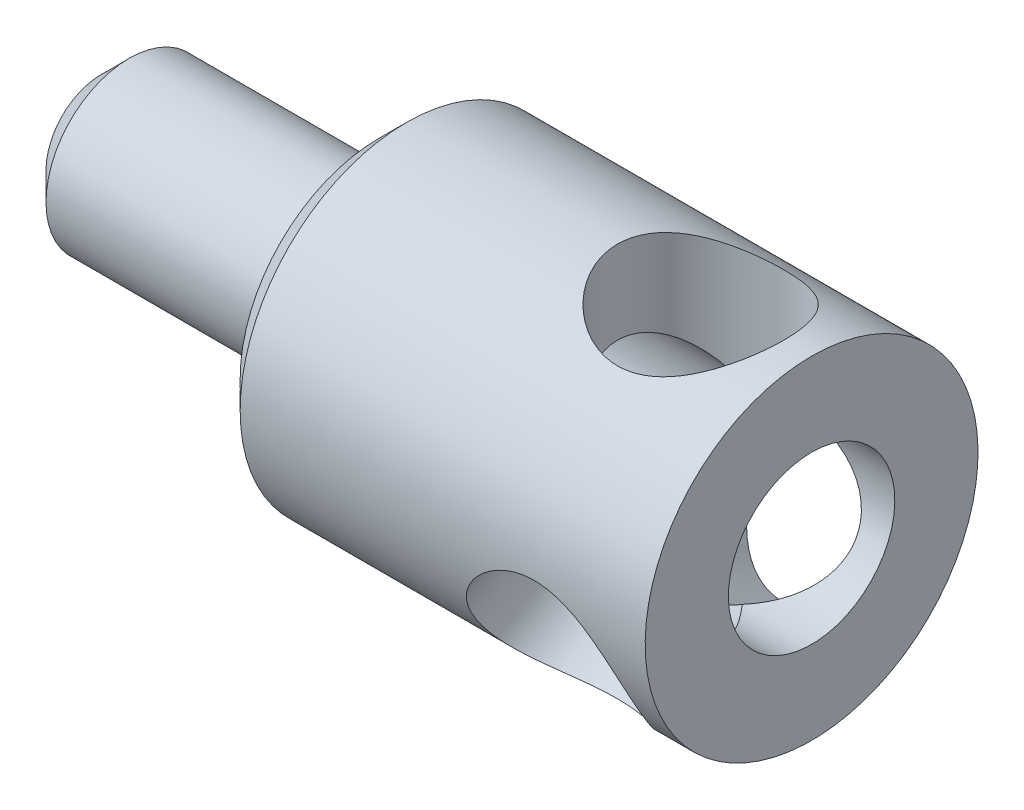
ISO-10303-21;
HEADER;
FILE_DESCRIPTION(('STEP AP214'),'2;1');
FILE_NAME('part.step','',(''),(''),'','','');
FILE_SCHEMA(('AUTOMOTIVE_DESIGN { 1 0 10303 214 1 1 1 1 }'));
ENDSEC;
DATA;
#1=APPLICATION_CONTEXT('core data for automotive mechanical design processes');
#2=APPLICATION_PROTOCOL_DEFINITION('international standard','automotive_design',2000,#1);
#3=PRODUCT_CONTEXT('',#1,'mechanical');
#4=PRODUCT('Part','Part','',(#3));
#5=PRODUCT_RELATED_PRODUCT_CATEGORY('part','',(#4));
#6=PRODUCT_DEFINITION_FORMATION('','',#4);
#7=PRODUCT_DEFINITION_CONTEXT('part definition',#1,'design');
#8=PRODUCT_DEFINITION('design','',#6,#7);
#9=PRODUCT_DEFINITION_SHAPE('','',#8);
#10=(LENGTH_UNIT() NAMED_UNIT(*) SI_UNIT(.MILLI.,.METRE.));
#11=(NAMED_UNIT(*) PLANE_ANGLE_UNIT() SI_UNIT($,.RADIAN.));
#12=(NAMED_UNIT(*) SI_UNIT($,.STERADIAN.) SOLID_ANGLE_UNIT());
#13=UNCERTAINTY_MEASURE_WITH_UNIT(LENGTH_MEASURE(1.E-05),#10,'distance_accuracy_value','');
#14=(GEOMETRIC_REPRESENTATION_CONTEXT(3) GLOBAL_UNCERTAINTY_ASSIGNED_CONTEXT((#13)) GLOBAL_UNIT_ASSIGNED_CONTEXT((#10,
#11,#12)) REPRESENTATION_CONTEXT('',''));
#15=CARTESIAN_POINT('',(0.,0.,0.));
#16=DIRECTION('',(0.,0.,1.));
#17=DIRECTION('',(1.,0.,0.));
#18=AXIS2_PLACEMENT_3D('',#15,#16,#17);
#19=CARTESIAN_POINT('',(4.15747878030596,-2.25,0.));
#20=DIRECTION('',(1.,0.,0.));
#21=DIRECTION('',(0.,1.,0.));
#22=AXIS2_PLACEMENT_3D('',#19,#20,#21);
#23=CYLINDRICAL_SURFACE('',#22,1.5);
#24=CARTESIAN_POINT('',(0.,-2.25,0.));
#25=DIRECTION('',(0.707106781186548,-0.353553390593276,-0.612372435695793));
#26=DIRECTION('',(-0.707106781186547,-0.353553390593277,-0.612372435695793));
#27=AXIS2_PLACEMENT_3D('',#24,#25,#26);
#28=ELLIPSE('',#27,2.12132034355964,1.5);
#29=CARTESIAN_POINT('',(-0.749999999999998,-3.75,0.));
#30=VERTEX_POINT('',#29);
#31=CARTESIAN_POINT('',(-0.749999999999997,-1.5,-1.29903810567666));
#32=VERTEX_POINT('',#31);
#33=EDGE_CURVE('E146',#30,#32,#28,.T.);
#34=ORIENTED_EDGE('',*,*,#33,.T.);
#35=CARTESIAN_POINT('',(0.,-2.25,0.));
#36=DIRECTION('',(0.707106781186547,0.707106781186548,0.));
#37=DIRECTION('',(-0.707106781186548,0.707106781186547,0.));
#38=AXIS2_PLACEMENT_3D('',#35,#36,#37);
#39=ELLIPSE('',#38,2.12132034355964,1.5);
#40=CARTESIAN_POINT('',(-0.750000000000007,-1.49999999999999,1.29903810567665));
#41=VERTEX_POINT('',#40);
#42=EDGE_CURVE('E80',#32,#41,#39,.T.);
#43=ORIENTED_EDGE('',*,*,#42,.T.);
#44=CARTESIAN_POINT('',(0.,-2.25,0.));
#45=DIRECTION('',(0.707106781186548,-0.353553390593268,0.612372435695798));
#46=DIRECTION('',(-0.707106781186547,-0.353553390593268,0.612372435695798));
#47=AXIS2_PLACEMENT_3D('',#44,#45,#46);
#48=ELLIPSE('',#47,2.12132034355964,1.5);
#49=EDGE_CURVE('E42',#41,#30,#48,.T.);
#50=ORIENTED_EDGE('',*,*,#49,.T.);
#51=EDGE_LOOP('',(#34,#43,#50));
#52=FACE_BOUND('',#51,.T.);
#53=CARTESIAN_POINT('',(-4.8,-2.25,0.));
#54=DIRECTION('',(1.,0.,0.));
#55=DIRECTION('',(0.,1.,0.));
#56=AXIS2_PLACEMENT_3D('',#53,#54,#55);
#57=CIRCLE('',#56,1.5);
#58=CARTESIAN_POINT('',(-4.8,-0.75,0.));
#59=VERTEX_POINT('',#58);
#60=EDGE_CURVE('E149',#59,#59,#57,.T.);
#61=ORIENTED_EDGE('',*,*,#60,.F.);
#62=EDGE_LOOP('',(#61));
#63=FACE_BOUND('',#62,.T.);
#64=ADVANCED_FACE('F27',(#52,#63),#23,.F.);
#65=CARTESIAN_POINT('',(2.,-0.75,0.));
#66=DIRECTION('',(1.,0.,0.));
#67=DIRECTION('',(0.,1.,0.));
#68=AXIS2_PLACEMENT_3D('',#65,#66,#67);
#69=PLANE('',#68);
#70=CARTESIAN_POINT('',(2.,-2.25,0.));
#71=DIRECTION('',(1.,0.,0.));
#72=DIRECTION('',(0.,1.,0.));
#73=AXIS2_PLACEMENT_3D('',#70,#71,#72);
#74=CIRCLE('',#73,3.);
#75=CARTESIAN_POINT('',(2.,0.75,0.));
#76=VERTEX_POINT('',#75);
#77=EDGE_CURVE('E152',#76,#76,#74,.T.);
#78=ORIENTED_EDGE('',*,*,#77,.T.);
#79=EDGE_LOOP('',(#78));
#80=FACE_BOUND('',#79,.T.);
#81=CARTESIAN_POINT('',(2.,-2.25,0.));
#82=DIRECTION('',(1.,0.,0.));
#83=DIRECTION('',(0.,1.,0.));
#84=AXIS2_PLACEMENT_3D('',#81,#82,#83);
#85=CIRCLE('',#84,1.5);
#86=CARTESIAN_POINT('',(2.,-0.75,0.));
#87=VERTEX_POINT('',#86);
#88=EDGE_CURVE('E94',#87,#87,#85,.T.);
#89=ORIENTED_EDGE('',*,*,#88,.F.);
#90=EDGE_LOOP('',(#89));
#91=FACE_BOUND('',#90,.T.);
#92=ADVANCED_FACE('F29',(#80,#91),#69,.T.);
#93=CARTESIAN_POINT('',(4.15747878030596,-2.25,0.));
#94=DIRECTION('',(1.,0.,0.));
#95=DIRECTION('',(0.,1.,0.));
#96=AXIS2_PLACEMENT_3D('',#93,#94,#95);
#97=CYLINDRICAL_SURFACE('',#96,3.);
#98=CARTESIAN_POINT('',(0.,-2.25000000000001,-3.));
#99=CARTESIAN_POINT('',(0.0781617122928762,-2.25000812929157,-3.0000031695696));
#100=CARTESIAN_POINT('',(0.156422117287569,-2.25711649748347,-3.00002604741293));
#101=CARTESIAN_POINT('',(0.31054089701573,-2.28501996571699,-2.99982598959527));
#102=CARTESIAN_POINT('',(0.386393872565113,-2.30584382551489,-2.99960253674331));
#103=CARTESIAN_POINT('',(0.533177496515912,-2.35959059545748,-2.9981163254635));
#104=CARTESIAN_POINT('',(0.604131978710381,-2.39244916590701,-2.99685905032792));
#105=CARTESIAN_POINT('',(0.74013630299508,-2.46851027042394,-2.99227346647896));
#106=CARTESIAN_POINT('',(0.805185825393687,-2.51171336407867,-2.98894504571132));
#107=CARTESIAN_POINT('',(0.933458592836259,-2.61066478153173,-2.9786893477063));
#108=CARTESIAN_POINT('',(0.996088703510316,-2.66715391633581,-2.97148788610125));
#109=CARTESIAN_POINT('',(1.11211258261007,-2.78820752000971,-2.95196419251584));
#110=CARTESIAN_POINT('',(1.16550174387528,-2.85277598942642,-2.93963941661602));
#111=CARTESIAN_POINT('',(1.2650507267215,-2.99254453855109,-2.9075935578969));
#112=CARTESIAN_POINT('',(1.3104806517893,-3.0681678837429,-2.88742991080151));
#113=CARTESIAN_POINT('',(1.38771127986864,-3.22359605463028,-2.83878891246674));
#114=CARTESIAN_POINT('',(1.41952058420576,-3.3033982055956,-2.81031682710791));
#115=CARTESIAN_POINT('',(1.46625699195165,-3.45835476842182,-2.74706668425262));
#116=CARTESIAN_POINT('',(1.4822242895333,-3.5334358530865,-2.71288147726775));
#117=CARTESIAN_POINT('',(1.50024917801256,-3.68176562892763,-2.63760269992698));
#118=CARTESIAN_POINT('',(1.50231518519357,-3.75501540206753,-2.59651332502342));
#119=CARTESIAN_POINT('',(1.49287998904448,-3.8908989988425,-2.51262286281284));
#120=CARTESIAN_POINT('',(1.48254297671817,-3.95390206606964,-2.4702813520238));
#121=CARTESIAN_POINT('',(1.45067873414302,-4.07466531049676,-2.38247170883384));
#122=CARTESIAN_POINT('',(1.42915066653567,-4.1324250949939,-2.3370033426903));
#123=CARTESIAN_POINT('',(1.37537615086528,-4.24240210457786,-2.24401349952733));
#124=CARTESIAN_POINT('',(1.3429855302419,-4.29453158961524,-2.19647232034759));
#125=CARTESIAN_POINT('',(1.26860487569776,-4.39178663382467,-2.10175286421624));
#126=CARTESIAN_POINT('',(1.22661140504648,-4.43690967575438,-2.0545747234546));
#127=CARTESIAN_POINT('',(1.12965697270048,-4.52392369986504,-1.95803039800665));
#128=CARTESIAN_POINT('',(1.07384545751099,-4.56510597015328,-1.90887894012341));
#129=CARTESIAN_POINT('',(0.953115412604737,-4.63899862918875,-1.81555389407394));
#130=CARTESIAN_POINT('',(0.888189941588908,-4.6717025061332,-1.77138414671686));
#131=CARTESIAN_POINT('',(0.74602771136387,-4.73060173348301,-1.68801223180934));
#132=CARTESIAN_POINT('',(0.668270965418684,-4.7562518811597,-1.6493036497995));
#133=CARTESIAN_POINT('',(0.505593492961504,-4.79822335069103,-1.58369497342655));
#134=CARTESIAN_POINT('',(0.420680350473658,-4.81455440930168,-1.55678256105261));
#135=CARTESIAN_POINT('',(0.253178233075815,-4.83696947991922,-1.51922194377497));
#136=CARTESIAN_POINT('',(0.170938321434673,-4.84376296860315,-1.50745387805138));
#137=CARTESIAN_POINT('',(0.00539798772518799,-4.84939307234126,-1.49773003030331));
#138=CARTESIAN_POINT('',(-0.0779016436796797,-4.8482353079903,-1.49976449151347));
#139=CARTESIAN_POINT('',(-0.233480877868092,-4.83855303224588,-1.51639723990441));
#140=CARTESIAN_POINT('',(-0.305969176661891,-4.83084823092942,-1.52959681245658));
#141=CARTESIAN_POINT('',(-0.447551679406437,-4.80919105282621,-1.56556007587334));
#142=CARTESIAN_POINT('',(-0.516644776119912,-4.79523665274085,-1.58832686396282));
#143=CARTESIAN_POINT('',(-0.653116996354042,-4.76029624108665,-1.64301786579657));
#144=CARTESIAN_POINT('',(-0.720268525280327,-4.73901449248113,-1.67531737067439));
#145=CARTESIAN_POINT('',(-0.848203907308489,-4.6895492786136,-1.74656210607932));
#146=CARTESIAN_POINT('',(-0.908984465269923,-4.66136226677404,-1.78551074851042));
#147=CARTESIAN_POINT('',(-1.03046815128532,-4.59394724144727,-1.873324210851));
#148=CARTESIAN_POINT('',(-1.09019572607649,-4.55377534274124,-1.9228201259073));
#149=CARTESIAN_POINT('',(-1.19911835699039,-4.46435219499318,-2.02515702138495));
#150=CARTESIAN_POINT('',(-1.24830985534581,-4.41509788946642,-2.07799912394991));
#151=CARTESIAN_POINT('',(-1.33586058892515,-4.30621512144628,-2.18586297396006));
#152=CARTESIAN_POINT('',(-1.37389967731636,-4.24634717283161,-2.24090544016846));
#153=CARTESIAN_POINT('',(-1.43570685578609,-4.11801997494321,-2.3489384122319));
#154=CARTESIAN_POINT('',(-1.45948747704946,-4.04956833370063,-2.401930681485));
#155=CARTESIAN_POINT('',(-1.49005284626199,-3.91245775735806,-2.49852225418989));
#156=CARTESIAN_POINT('',(-1.49819681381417,-3.84439410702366,-2.54253726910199));
#157=CARTESIAN_POINT('',(-1.5012648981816,-3.70468598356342,-2.62496799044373));
#158=CARTESIAN_POINT('',(-1.49619364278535,-3.63304277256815,-2.6633856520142));
#159=CARTESIAN_POINT('',(-1.47387538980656,-3.49339057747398,-2.73122963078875));
#160=CARTESIAN_POINT('',(-1.45745272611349,-3.42545319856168,-2.76108161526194));
#161=CARTESIAN_POINT('',(-1.41400950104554,-3.29058555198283,-2.81468490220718));
#162=CARTESIAN_POINT('',(-1.38698741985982,-3.22365543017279,-2.83843532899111));
#163=CARTESIAN_POINT('',(-1.32190942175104,-3.08985135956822,-2.88093544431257));
#164=CARTESIAN_POINT('',(-1.28343101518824,-3.02310224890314,-2.8994278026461));
#165=CARTESIAN_POINT('',(-1.19706310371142,-2.89453569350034,-2.93069249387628));
#166=CARTESIAN_POINT('',(-1.14916927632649,-2.832720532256,-2.94346219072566));
#167=CARTESIAN_POINT('',(-1.03980429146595,-2.70987173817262,-2.96526322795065));
#168=CARTESIAN_POINT('',(-0.977456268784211,-2.6495281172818,-2.9737960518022));
#169=CARTESIAN_POINT('',(-0.843823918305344,-2.53900788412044,-2.98656620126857));
#170=CARTESIAN_POINT('',(-0.772531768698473,-2.48884027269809,-2.99079973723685));
#171=CARTESIAN_POINT('',(-0.620045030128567,-2.39971429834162,-2.99660601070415));
#172=CARTESIAN_POINT('',(-0.538608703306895,-2.36116027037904,-2.99809043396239));
#173=CARTESIAN_POINT('',(-0.370001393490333,-2.30028773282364,-2.99973703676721));
#174=CARTESIAN_POINT('',(-0.28285066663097,-2.27791493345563,-2.99990365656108));
#175=CARTESIAN_POINT('',(-0.162291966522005,-2.25974891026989,-2.99998663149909));
#176=CARTESIAN_POINT('',(-0.129948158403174,-2.25610053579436,-2.99999475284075));
#177=CARTESIAN_POINT('',(-0.0650752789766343,-2.2512243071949,-3.0000007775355));
#178=CARTESIAN_POINT('',(-0.0325461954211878,-2.24999661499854,-2.99999868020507));
#179=CARTESIAN_POINT('',(0.,-2.25000000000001,-3.));
#180=B_SPLINE_CURVE_WITH_KNOTS('',3,(#98,#99,#100,#101,#102,#103,#104,#105,#106,#107,#108,#109,
#110,#111,#112,#113,#114,#115,#116,#117,#118,#119,#120,#121,#122,#123,#124,#125,#126,#127,#128,
#129,#130,#131,#132,#133,#134,#135,#136,#137,#138,#139,#140,#141,#142,#143,#144,#145,#146,#147,
#148,#149,#150,#151,#152,#153,#154,#155,#156,#157,#158,#159,#160,#161,#162,#163,#164,#165,#166,
#167,#168,#169,#170,#171,#172,#173,#174,#175,#176,#177,#178,#179),.UNSPECIFIED.,.T.,.F.,(4,2,2,
2,2,2,2,2,2,2,2,2,2,2,2,2,2,2,2,2,2,2,2,2,2,2,2,2,2,2,2,2,2,2,2,2,2,2,2,2,4),(0.,
0.234348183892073,0.469189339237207,0.702792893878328,0.936409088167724,1.18929346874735,
1.44230356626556,1.71236838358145,1.98226240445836,2.23295227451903,2.4834903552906,
2.71224146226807,2.94100968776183,3.1729430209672,3.40495949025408,3.65890787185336,
3.91305072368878,4.18333262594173,4.45333161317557,4.70193436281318,4.9503613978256,
5.17161275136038,5.39293578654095,5.62450944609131,5.85620229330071,6.1171011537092,
6.37808797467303,6.64596272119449,6.91360169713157,7.1566840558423,7.39968130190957,
7.62666637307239,7.85368400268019,8.09041126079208,8.32724745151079,8.58765362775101,
8.84828914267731,9.11716123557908,9.38512699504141,9.48270202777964,9.58028358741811),.UNSPECIFIED.);
#181=CARTESIAN_POINT('',(0.,-2.25000000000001,-3.));
#182=VERTEX_POINT('',#181);
#183=EDGE_CURVE('E81',#182,#182,#180,.T.);
#184=ORIENTED_EDGE('',*,*,#183,.F.);
#185=EDGE_LOOP('',(#184));
#186=FACE_BOUND('',#185,.T.);
#187=CARTESIAN_POINT('',(0.,-4.8480762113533,1.50000000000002));
#188=CARTESIAN_POINT('',(0.0781617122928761,-4.84807489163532,1.50000862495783));
#189=CARTESIAN_POINT('',(0.156422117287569,-4.84454052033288,1.50617609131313));
#190=CARTESIAN_POINT('',(0.31054089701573,-4.8304155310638,1.53024117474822));
#191=CARTESIAN_POINT('',(0.386393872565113,-4.8198100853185,1.54816343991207));
#192=CARTESIAN_POINT('',(0.533177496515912,-4.79164960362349,1.5939664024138));
#193=CARTESIAN_POINT('',(0.604131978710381,-4.77413148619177,1.62179412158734));
#194=CARTESIAN_POINT('',(0.74013630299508,-4.73212970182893,1.68537217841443));
#195=CARTESIAN_POINT('',(0.805185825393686,-4.7076456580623,1.72112294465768));
#196=CARTESIAN_POINT('',(0.933458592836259,-4.64928825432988,1.80168953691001));
#197=CARTESIAN_POINT('',(0.996088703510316,-4.61480703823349,1.84700983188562));
#198=CARTESIAN_POINT('',(1.11211258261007,-4.53737222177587,1.94208348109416));
#199=CARTESIAN_POINT('',(1.16550174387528,-4.49441441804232,1.9918390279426));
#200=CARTESIAN_POINT('',(1.2650507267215,-4.39677761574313,2.0968592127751));
#201=CARTESIAN_POINT('',(1.3104806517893,-4.34150371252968,2.15226912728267));
#202=CARTESIAN_POINT('',(1.38771127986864,-4.22166528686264,2.26255337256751));
#203=CARTESIAN_POINT('',(1.41952058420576,-4.15710666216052,2.31742801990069));
#204=CARTESIAN_POINT('',(1.46625699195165,-4.02485215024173,2.41999926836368));
#205=CARTESIAN_POINT('',(1.4822242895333,-3.95770635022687,2.46792879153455));
#206=CARTESIAN_POINT('',(1.50024917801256,-3.81834812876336,2.55874675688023));
#207=CARTESIAN_POINT('',(1.50231518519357,-3.74613879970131,2.60163823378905));
#208=CARTESIAN_POINT('',(1.49287998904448,-3.60554572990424,2.67737164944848));
#209=CARTESIAN_POINT('',(1.48254297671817,-3.53737537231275,2.71076315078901));
#210=CARTESIAN_POINT('',(1.45067873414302,-3.40094836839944,2.77144236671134));
#211=CARTESIAN_POINT('',(1.42915066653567,-3.33269171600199,2.79872962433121));
#212=CARTESIAN_POINT('',(1.37537615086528,-3.19717164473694,2.84747758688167));
#213=CARTESIAN_POINT('',(1.3429855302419,-3.12993503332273,2.86885245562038));
#214=CARTESIAN_POINT('',(1.26860487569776,-2.99927805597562,2.90571806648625));
#215=CARTESIAN_POINT('',(1.22661140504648,-2.93585906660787,2.92120669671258));
#216=CARTESIAN_POINT('',(1.12965697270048,-2.80874221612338,2.94829088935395));
#217=CARTESIAN_POINT('',(1.07384545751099,-2.74558466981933,2.95938005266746));
#218=CARTESIAN_POINT('',(0.953115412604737,-2.62781647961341,2.97671044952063));
#219=CARTESIAN_POINT('',(0.888189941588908,-2.57321241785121,2.98294796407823));
#220=CARTESIAN_POINT('',(0.746027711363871,-2.47156060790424,2.99227023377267));
#221=CARTESIAN_POINT('',(0.668270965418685,-2.42521291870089,2.99512962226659));
#222=CARTESIAN_POINT('',(0.505593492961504,-2.34740840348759,2.99867364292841));
#223=CARTESIAN_POINT('',(0.420680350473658,-2.31593604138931,2.99936054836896));
#224=CARTESIAN_POINT('',(0.253178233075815,-2.27220005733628,2.99999226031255));
#225=CARTESIAN_POINT('',(0.170938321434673,-2.25861186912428,2.99999156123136));
#226=CARTESIAN_POINT('',(0.0053979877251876,-2.24737571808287,3.00000545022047));
#227=CARTESIAN_POINT('',(-0.0779016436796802,-2.24971649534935,3.00002002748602));
#228=CARTESIAN_POINT('',(-0.233480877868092,-2.26896201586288,2.99995130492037));
#229=CARTESIAN_POINT('',(-0.30596917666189,-2.28424558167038,2.99987853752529));
#230=CARTESIAN_POINT('',(-0.447551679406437,-2.32621927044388,2.99910450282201));
#231=CARTESIAN_POINT('',(-0.516644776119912,-2.35291308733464,2.99840303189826));
#232=CARTESIAN_POINT('',(-0.653116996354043,-2.41774709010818,2.99548924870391));
#233=CARTESIAN_POINT('',(-0.720268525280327,-2.45636015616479,2.99320846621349));
#234=CARTESIAN_POINT('',(-0.848203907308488,-2.54279251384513,2.98599270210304));
#235=CARTESIAN_POINT('',(-0.908984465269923,-2.59061653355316,2.98105635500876));
#236=CARTESIAN_POINT('',(-1.03046815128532,-2.70037273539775,2.96657996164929));
#237=CARTESIAN_POINT('',(-1.09019572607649,-2.76332340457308,2.95653803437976));
#238=CARTESIAN_POINT('',(-1.19911835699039,-2.89666132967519,2.9302637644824));
#239=CARTESIAN_POINT('',(-1.24830985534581,-2.96705108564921,2.91402933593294));
#240=CARTESIAN_POINT('',(-1.33586058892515,-3.11490530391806,2.87366601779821));
#241=CARTESIAN_POINT('',(-1.37389967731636,-3.19250745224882,2.84934008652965));
#242=CARTESIAN_POINT('',(-1.43570685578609,-3.35023034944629,2.79222195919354));
#243=CARTESIAN_POINT('',(-1.45948747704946,-3.43034882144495,2.75943723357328));
#244=CARTESIAN_POINT('',(-1.49005284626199,-3.58255486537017,2.68899177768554));
#245=CARTESIAN_POINT('',(-1.49819681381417,-3.65470481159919,2.6520544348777));
#246=CARTESIAN_POINT('',(-1.5012648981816,-3.79594597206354,2.57227901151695));
#247=CARTESIAN_POINT('',(-1.49619364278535,-3.86503824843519,2.52944300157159));
#248=CARTESIAN_POINT('',(-1.47387538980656,-3.99361895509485,2.44242264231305));
#249=CARTESIAN_POINT('',(-1.45745272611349,-4.05344022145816,2.39851313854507));
#250=CARTESIAN_POINT('',(-1.41400950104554,-4.16729585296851,2.30851597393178));
#251=CARTESIAN_POINT('',(-1.38698741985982,-4.22132938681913,2.26242800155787));
#252=CARTESIAN_POINT('',(-1.32190942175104,-4.32503760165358,2.16780033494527));
#253=CARTESIAN_POINT('',(-1.28343101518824,-4.37442700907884,2.11924008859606));
#254=CARTESIAN_POINT('',(-1.19706310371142,-4.46578630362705,2.02353053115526));
#255=CARTESIAN_POINT('',(-1.14916927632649,-4.50775276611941,1.97638187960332));
#256=CARTESIAN_POINT('',(-1.03980429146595,-4.58805741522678,1.88089222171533));
#257=CARTESIAN_POINT('',(-0.977456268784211,-4.62561886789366,1.83289952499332));
#258=CARTESIAN_POINT('',(-0.843823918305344,-4.69193825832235,1.74357127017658));
#259=CARTESIAN_POINT('',(-0.772531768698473,-4.72068841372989,1.70224161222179));
#260=CARTESIAN_POINT('',(-0.620045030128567,-4.77027978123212,1.62795939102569));
#261=CARTESIAN_POINT('',(-0.538608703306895,-4.79084234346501,1.595312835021));
#262=CARTESIAN_POINT('',(-0.370001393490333,-4.82270461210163,1.54341897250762));
#263=CARTESIAN_POINT('',(-0.28285066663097,-4.8340353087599,1.52412686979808));
#264=CARTESIAN_POINT('',(-0.162291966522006,-4.84319017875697,1.5084361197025));
#265=CARTESIAN_POINT('',(-0.129948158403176,-4.84502139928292,1.50528059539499));
#266=CARTESIAN_POINT('',(-0.0650752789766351,-4.84746473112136,1.50106066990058));
#267=CARTESIAN_POINT('',(-0.0325461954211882,-4.8480767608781,1.49999640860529));
#268=CARTESIAN_POINT('',(0.,-4.8480762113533,1.50000000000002));
#269=B_SPLINE_CURVE_WITH_KNOTS('',3,(#187,#188,#189,#190,#191,#192,#193,#194,#195,#196,#197,
#198,#199,#200,#201,#202,#203,#204,#205,#206,#207,#208,#209,#210,#211,#212,#213,#214,#215,#216,
#217,#218,#219,#220,#221,#222,#223,#224,#225,#226,#227,#228,#229,#230,#231,#232,#233,#234,#235,
#236,#237,#238,#239,#240,#241,#242,#243,#244,#245,#246,#247,#248,#249,#250,#251,#252,#253,#254,
#255,#256,#257,#258,#259,#260,#261,#262,#263,#264,#265,#266,#267,#268),.UNSPECIFIED.,.T.,.F.,(4,
2,2,2,2,2,2,2,2,2,2,2,2,2,2,2,2,2,2,2,2,2,2,2,2,2,2,2,2,2,2,2,2,2,2,2,2,2,2,2,4),(0.,
0.234348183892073,0.469189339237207,0.702792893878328,0.936409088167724,1.18929346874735,
1.44230356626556,1.71236838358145,1.98226240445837,2.23295227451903,2.4834903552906,
2.71224146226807,2.94100968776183,3.1729430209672,3.40495949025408,3.65890787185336,
3.91305072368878,4.18333262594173,4.45333161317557,4.70193436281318,4.9503613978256,
5.17161275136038,5.39293578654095,5.62450944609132,5.85620229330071,6.1171011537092,
6.37808797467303,6.64596272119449,6.91360169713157,7.1566840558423,7.39968130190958,
7.62666637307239,7.8536840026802,8.09041126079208,8.32724745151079,8.58765362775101,
8.84828914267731,9.11716123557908,9.3851269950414,9.48270202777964,9.58028358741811),.UNSPECIFIED.);
#270=CARTESIAN_POINT('',(0.,-4.8480762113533,1.50000000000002));
#271=VERTEX_POINT('',#270);
#272=EDGE_CURVE('E86',#271,#271,#269,.T.);
#273=ORIENTED_EDGE('',*,*,#272,.F.);
#274=EDGE_LOOP('',(#273));
#275=FACE_BOUND('',#274,.T.);
#276=CARTESIAN_POINT('',(-1.5,0.749999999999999,0.));
#277=CARTESIAN_POINT('',(-1.49999504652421,0.749995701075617,0.0788579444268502));
#278=CARTESIAN_POINT('',(-1.49374489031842,0.746857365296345,0.157809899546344));
#279=CARTESIAN_POINT('',(-1.46902067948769,0.734612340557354,0.313380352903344));
#280=CARTESIAN_POINT('',(-1.45052341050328,0.725494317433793,0.389994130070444));
#281=CARTESIAN_POINT('',(-1.40220928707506,0.702244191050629,0.538400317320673));
#282=CARTESIAN_POINT('',(-1.37243642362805,0.688131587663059,0.610210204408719));
#283=CARTESIAN_POINT('',(-1.30264406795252,0.656186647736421,0.747708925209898));
#284=CARTESIAN_POINT('',(-1.2626253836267,0.638354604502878,0.813398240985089));
#285=CARTESIAN_POINT('',(-1.17072412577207,0.599343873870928,0.941261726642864));
#286=CARTESIAN_POINT('',(-1.11827028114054,0.578027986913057,1.00298281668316));
#287=CARTESIAN_POINT('',(-1.00421778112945,0.534899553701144,1.11716916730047));
#288=CARTESIAN_POINT('',(-0.942612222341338,0.513086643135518,1.16962737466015));
#289=CARTESIAN_POINT('',(-0.806274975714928,0.469484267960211,1.26787800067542));
#290=CARTESIAN_POINT('',(-0.730895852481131,0.447827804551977,1.31283800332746));
#291=CARTESIAN_POINT('',(-0.572448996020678,0.409289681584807,1.38925234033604));
#292=CARTESIAN_POINT('',(-0.489386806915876,0.392404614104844,1.4207163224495));
#293=CARTESIAN_POINT('',(-0.323002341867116,0.366868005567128,1.46719866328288));
#294=CARTESIAN_POINT('',(-0.239993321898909,0.357784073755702,1.48308878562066));
#295=CARTESIAN_POINT('',(-0.0720317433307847,0.347728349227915,1.50064048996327));
#296=CARTESIAN_POINT('',(0.0129188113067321,0.346748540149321,1.50231613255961));
#297=CARTESIAN_POINT('',(0.171429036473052,0.352663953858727,1.49203093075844));
#298=CARTESIAN_POINT('',(0.245136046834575,0.358631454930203,1.48167683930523));
#299=CARTESIAN_POINT('',(0.389582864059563,0.376143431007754,1.4504097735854));
#300=CARTESIAN_POINT('',(0.460321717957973,0.387689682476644,1.42949343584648));
#301=CARTESIAN_POINT('',(0.598843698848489,0.415312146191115,1.37731467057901));
#302=CARTESIAN_POINT('',(0.666519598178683,0.431487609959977,1.34582260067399));
#303=CARTESIAN_POINT('',(0.795951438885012,0.466551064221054,1.273562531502));
#304=CARTESIAN_POINT('',(0.857704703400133,0.485440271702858,1.2327903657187));
#305=CARTESIAN_POINT('',(0.981781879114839,0.526697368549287,1.13709908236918));
#306=CARTESIAN_POINT('',(1.04318531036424,0.549202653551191,1.08104168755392));
#307=CARTESIAN_POINT('',(1.15610312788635,0.593214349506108,0.959333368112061));
#308=CARTESIAN_POINT('',(1.20761278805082,0.614720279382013,0.893677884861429));
#309=CARTESIAN_POINT('',(1.30152849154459,0.655529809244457,0.750774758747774));
#310=CARTESIAN_POINT('',(1.34340070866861,0.674684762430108,0.673130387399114));
#311=CARTESIAN_POINT('',(1.41314554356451,0.707368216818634,0.510699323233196));
#312=CARTESIAN_POINT('',(1.44102927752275,0.720901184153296,0.425918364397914));
#313=CARTESIAN_POINT('',(1.47971310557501,0.739865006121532,0.259149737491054));
#314=CARTESIAN_POINT('',(1.49173685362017,0.745874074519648,0.17751229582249));
#315=CARTESIAN_POINT('',(1.50219709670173,0.751095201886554,0.0131693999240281));
#316=CARTESIAN_POINT('',(1.5006400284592,0.750310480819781,-0.0695355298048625));
#317=CARTESIAN_POINT('',(1.48468996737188,0.742367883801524,-0.22684945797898));
#318=CARTESIAN_POINT('',(1.47130120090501,0.735708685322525,-0.301589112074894));
#319=CARTESIAN_POINT('',(1.43364289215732,0.717332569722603,-0.447610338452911));
#320=CARTESIAN_POINT('',(1.40937215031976,0.705615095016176,-0.51889152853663));
#321=CARTESIAN_POINT('',(1.35000230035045,0.677763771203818,-0.658332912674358));
#322=CARTESIAN_POINT('',(1.31461342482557,0.661513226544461,-0.726345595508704));
#323=CARTESIAN_POINT('',(1.23433869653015,0.626159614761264,-0.855692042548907));
#324=CARTESIAN_POINT('',(1.18944879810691,0.607055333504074,-0.917022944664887));
#325=CARTESIAN_POINT('',(1.08635936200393,0.56562332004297,-1.03765153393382));
#326=CARTESIAN_POINT('',(1.02728569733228,0.543163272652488,-1.09615811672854));
#327=CARTESIAN_POINT('',(0.900112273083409,0.498935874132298,-1.20278448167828));
#328=CARTESIAN_POINT('',(0.832006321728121,0.477169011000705,-1.25089707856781));
#329=CARTESIAN_POINT('',(0.684534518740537,0.43576788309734,-1.33756187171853));
#330=CARTESIAN_POINT('',(0.604783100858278,0.41628794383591,-1.37553824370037));
#331=CARTESIAN_POINT('',(0.438734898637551,0.38361108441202,-1.43712423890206));
#332=CARTESIAN_POINT('',(0.352446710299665,0.370406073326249,-1.46075237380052));
#333=CARTESIAN_POINT('',(0.184634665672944,0.353422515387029,-1.49079253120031));
#334=CARTESIAN_POINT('',(0.103448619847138,0.348860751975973,-1.49863949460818));
#335=CARTESIAN_POINT('',(-0.0591706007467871,0.347480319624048,-1.5010337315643));
#336=CARTESIAN_POINT('',(-0.140603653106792,0.35065829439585,-1.49558676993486));
#337=CARTESIAN_POINT('',(-0.293225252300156,0.363567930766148,-1.47288918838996));
#338=CARTESIAN_POINT('',(-0.364650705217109,0.372646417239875,-1.45681247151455));
#339=CARTESIAN_POINT('',(-0.50371217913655,0.395565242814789,-1.41476303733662));
#340=CARTESIAN_POINT('',(-0.571346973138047,0.409407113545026,-1.38878713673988));
#341=CARTESIAN_POINT('',(-0.705937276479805,0.441427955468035,-1.32572361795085));
#342=CARTESIAN_POINT('',(-0.772541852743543,0.459835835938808,-1.28800670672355));
#343=CARTESIAN_POINT('',(-0.898911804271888,0.498529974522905,-1.20322645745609));
#344=CARTESIAN_POINT('',(-0.958673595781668,0.518817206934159,-1.15615825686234));
#345=CARTESIAN_POINT('',(-1.07721297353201,0.56193484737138,-1.04730498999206));
#346=CARTESIAN_POINT('',(-1.13498865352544,0.584774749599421,-0.984426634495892));
#347=CARTESIAN_POINT('',(-1.2393944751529,0.62816628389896,-0.849232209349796));
#348=CARTESIAN_POINT('',(-1.28601860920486,0.648716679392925,-0.776911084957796));
#349=CARTESIAN_POINT('',(-1.36685454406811,0.68547014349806,-0.623897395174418));
#350=CARTESIAN_POINT('',(-1.4009762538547,0.701641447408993,-0.543149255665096));
#351=CARTESIAN_POINT('',(-1.45471225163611,0.727520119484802,-0.37611315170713));
#352=CARTESIAN_POINT('',(-1.47436777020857,0.737245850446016,-0.28984169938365));
#353=CARTESIAN_POINT('',(-1.49084611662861,0.745431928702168,-0.168902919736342));
#354=CARTESIAN_POINT('',(-1.49427396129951,0.747140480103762,-0.135242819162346));
#355=CARTESIAN_POINT('',(-1.49885199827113,0.749425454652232,-0.0677275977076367));
#356=CARTESIAN_POINT('',(-1.50000212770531,0.750001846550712,-0.0338724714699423));
#357=CARTESIAN_POINT('',(-1.5,0.749999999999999,0.));
#358=B_SPLINE_CURVE_WITH_KNOTS('',3,(#276,#277,#278,#279,#280,#281,#282,#283,#284,#285,#286,
#287,#288,#289,#290,#291,#292,#293,#294,#295,#296,#297,#298,#299,#300,#301,#302,#303,#304,#305,
#306,#307,#308,#309,#310,#311,#312,#313,#314,#315,#316,#317,#318,#319,#320,#321,#322,#323,#324,
#325,#326,#327,#328,#329,#330,#331,#332,#333,#334,#335,#336,#337,#338,#339,#340,#341,#342,#343,
#344,#345,#346,#347,#348,#349,#350,#351,#352,#353,#354,#355,#356,#357),.UNSPECIFIED.,.T.,.F.,(4,
2,2,2,2,2,2,2,2,2,2,2,2,2,2,2,2,2,2,2,2,2,2,2,2,2,2,2,2,2,2,2,2,2,2,2,2,2,2,2,4),(0.,
0.236436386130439,0.473322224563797,0.709293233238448,0.945245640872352,1.19547263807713,
1.44588935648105,1.71572589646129,1.98536921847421,2.23887018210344,2.49212035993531,
2.71508568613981,2.93812205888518,3.16635360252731,3.39468781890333,3.65197412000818,
3.90938301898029,4.17874533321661,4.44789325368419,4.69474935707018,4.94148846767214,
5.16910359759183,5.39674382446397,5.63089284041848,5.86514176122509,6.12239415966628,
6.37982382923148,6.64972023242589,6.91926767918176,7.1629396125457,7.40650589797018,
7.62686895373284,7.84730293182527,8.08254685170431,8.31791341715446,8.58187864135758,
8.84598575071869,9.1119602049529,9.37717362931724,9.47872920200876,9.58028757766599),.UNSPECIFIED.);
#359=CARTESIAN_POINT('',(-1.5,0.749999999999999,0.));
#360=VERTEX_POINT('',#359);
#361=EDGE_CURVE('E83',#360,#360,#358,.T.);
#362=ORIENTED_EDGE('',*,*,#361,.F.);
#363=EDGE_LOOP('',(#362));
#364=FACE_BOUND('',#363,.T.);
#365=CARTESIAN_POINT('',(-5.3,-2.25,0.));
#366=DIRECTION('',(-1.,0.,0.));
#367=DIRECTION('',(0.,0.,1.));
#368=AXIS2_PLACEMENT_3D('',#365,#366,#367);
#369=CIRCLE('',#368,3.);
#370=CARTESIAN_POINT('',(-5.3,-2.25,3.));
#371=VERTEX_POINT('',#370);
#372=EDGE_CURVE('E158',#371,#371,#369,.F.);
#373=ORIENTED_EDGE('',*,*,#372,.T.);
#374=EDGE_LOOP('',(#373));
#375=FACE_BOUND('',#374,.T.);
#376=ORIENTED_EDGE('',*,*,#77,.F.);
#377=EDGE_LOOP('',(#376));
#378=FACE_BOUND('',#377,.T.);
#379=ADVANCED_FACE('F96',(#186,#275,#364,#375,#378),#97,.T.);
#380=CARTESIAN_POINT('',(-5.8,0.749999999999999,0.));
#381=DIRECTION('',(-1.,0.,0.));
#382=DIRECTION('',(0.,-1.,0.));
#383=AXIS2_PLACEMENT_3D('',#380,#381,#382);
#384=PLANE('',#383);
#385=CARTESIAN_POINT('',(-5.8,-2.25,0.));
#386=DIRECTION('',(-1.,0.,0.));
#387=DIRECTION('',(0.,-1.,0.));
#388=AXIS2_PLACEMENT_3D('',#385,#386,#387);
#389=CIRCLE('',#388,2.5);
#390=CARTESIAN_POINT('',(-5.8,-4.75,0.));
#391=VERTEX_POINT('',#390);
#392=EDGE_CURVE('E161',#391,#391,#389,.T.);
#393=ORIENTED_EDGE('',*,*,#392,.T.);
#394=EDGE_LOOP('',(#393));
#395=FACE_BOUND('',#394,.T.);
#396=CARTESIAN_POINT('',(-5.8,-2.25,0.));
#397=DIRECTION('',(1.,0.,0.));
#398=DIRECTION('',(0.,1.,0.));
#399=AXIS2_PLACEMENT_3D('',#396,#397,#398);
#400=CIRCLE('',#399,1.5);
#401=CARTESIAN_POINT('',(-5.8,-0.750000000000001,0.));
#402=VERTEX_POINT('',#401);
#403=EDGE_CURVE('E150',#402,#402,#400,.T.);
#404=ORIENTED_EDGE('',*,*,#403,.T.);
#405=EDGE_LOOP('',(#404));
#406=FACE_BOUND('',#405,.T.);
#407=ADVANCED_FACE('F127',(#395,#406),#384,.T.);
#408=CARTESIAN_POINT('',(4.15747878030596,-2.25,0.));
#409=DIRECTION('',(1.,0.,0.));
#410=DIRECTION('',(0.,1.,0.));
#411=AXIS2_PLACEMENT_3D('',#408,#409,#410);
#412=CYLINDRICAL_SURFACE('',#411,1.5);
#413=CARTESIAN_POINT('',(-10.3,-2.25,0.));
#414=DIRECTION('',(-1.,0.,0.));
#415=DIRECTION('',(0.,-1.,0.));
#416=AXIS2_PLACEMENT_3D('',#413,#414,#415);
#417=CIRCLE('',#416,1.5);
#418=CARTESIAN_POINT('',(-10.3,-3.75,0.));
#419=VERTEX_POINT('',#418);
#420=EDGE_CURVE('E35',#419,#419,#417,.F.);
#421=ORIENTED_EDGE('',*,*,#420,.T.);
#422=EDGE_LOOP('',(#421));
#423=FACE_BOUND('',#422,.T.);
#424=ORIENTED_EDGE('',*,*,#403,.F.);
#425=EDGE_LOOP('',(#424));
#426=FACE_BOUND('',#425,.T.);
#427=ADVANCED_FACE('F124',(#423,#426),#412,.T.);
#428=CARTESIAN_POINT('',(-10.8,-0.750000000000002,0.));
#429=DIRECTION('',(-1.,0.,0.));
#430=DIRECTION('',(0.,-1.,0.));
#431=AXIS2_PLACEMENT_3D('',#428,#429,#430);
#432=PLANE('',#431);
#433=CARTESIAN_POINT('',(-10.8,-2.25,0.));
#434=DIRECTION('',(-1.,0.,0.));
#435=DIRECTION('',(0.,-1.,0.));
#436=AXIS2_PLACEMENT_3D('',#433,#434,#435);
#437=CIRCLE('',#436,1.);
#438=CARTESIAN_POINT('',(-10.8,-3.25,0.));
#439=VERTEX_POINT('',#438);
#440=EDGE_CURVE('E11',#439,#439,#437,.T.);
#441=ORIENTED_EDGE('',*,*,#440,.T.);
#442=EDGE_LOOP('',(#441));
#443=FACE_BOUND('',#442,.T.);
#444=ADVANCED_FACE('F120',(#443),#432,.T.);
#445=CARTESIAN_POINT('',(-5.66602540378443,-2.25,0.));
#446=DIRECTION('',(1.,0.,0.));
#447=DIRECTION('',(0.,1.,0.));
#448=AXIS2_PLACEMENT_3D('',#445,#446,#447);
#449=CONICAL_SURFACE('',#448,0.,1.0471975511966);
#450=ORIENTED_EDGE('',*,*,#60,.T.);
#451=EDGE_LOOP('',(#450));
#452=FACE_BOUND('',#451,.T.);
#453=CARTESIAN_POINT('',(-5.66602540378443,-2.25,0.));
#454=VERTEX_POINT('',#453);
#455=VERTEX_LOOP('',#454);
#456=FACE_BOUND('',#455,.T.);
#457=ADVANCED_FACE('F117',(#452,#456),#449,.F.);
#458=CARTESIAN_POINT('',(0.,-2.25,0.));
#459=DIRECTION('',(-0.707106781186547,-0.353553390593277,-0.612372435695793));
#460=DIRECTION('',(0.707106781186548,-0.353553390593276,-0.612372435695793));
#461=AXIS2_PLACEMENT_3D('',#458,#459,#460);
#462=ELLIPSE('',#461,2.12132034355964,1.5);
#463=CARTESIAN_POINT('',(0.749999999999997,-1.5,-1.29903810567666));
#464=VERTEX_POINT('',#463);
#465=CARTESIAN_POINT('',(0.749999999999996,-3.75,0.));
#466=VERTEX_POINT('',#465);
#467=EDGE_CURVE('E75',#464,#466,#462,.T.);
#468=ORIENTED_EDGE('',*,*,#467,.T.);
#469=CARTESIAN_POINT('',(0.,-2.25,0.));
#470=DIRECTION('',(-0.707106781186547,-0.353553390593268,0.612372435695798));
#471=DIRECTION('',(0.707106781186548,-0.353553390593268,0.612372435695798));
#472=AXIS2_PLACEMENT_3D('',#469,#470,#471);
#473=ELLIPSE('',#472,2.12132034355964,1.5);
#474=CARTESIAN_POINT('',(0.750000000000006,-1.49999999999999,1.29903810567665));
#475=VERTEX_POINT('',#474);
#476=EDGE_CURVE('E63',#466,#475,#473,.T.);
#477=ORIENTED_EDGE('',*,*,#476,.T.);
#478=CARTESIAN_POINT('',(0.,-2.25,0.));
#479=DIRECTION('',(-0.707106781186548,0.707106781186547,0.));
#480=DIRECTION('',(0.707106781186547,0.707106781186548,0.));
#481=AXIS2_PLACEMENT_3D('',#478,#479,#480);
#482=ELLIPSE('',#481,2.12132034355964,1.5);
#483=EDGE_CURVE('E74',#475,#464,#482,.T.);
#484=ORIENTED_EDGE('',*,*,#483,.T.);
#485=EDGE_LOOP('',(#468,#477,#484));
#486=FACE_BOUND('',#485,.T.);
#487=ORIENTED_EDGE('',*,*,#88,.T.);
#488=EDGE_LOOP('',(#487));
#489=FACE_BOUND('',#488,.T.);
#490=ADVANCED_FACE('F72',(#486,#489),#23,.F.);
#491=CARTESIAN_POINT('',(-5.3,-2.25,0.));
#492=DIRECTION('',(1.,0.,0.));
#493=DIRECTION('',(0.,0.,-1.));
#494=AXIS2_PLACEMENT_3D('',#491,#492,#493);
#495=CONICAL_SURFACE('',#494,3.,0.78539816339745);
#496=ORIENTED_EDGE('',*,*,#392,.F.);
#497=EDGE_LOOP('',(#496));
#498=FACE_BOUND('',#497,.T.);
#499=ORIENTED_EDGE('',*,*,#372,.F.);
#500=EDGE_LOOP('',(#499));
#501=FACE_BOUND('',#500,.T.);
#502=ADVANCED_FACE('F110',(#498,#501),#495,.T.);
#503=CARTESIAN_POINT('',(-10.3,-2.25,0.));
#504=DIRECTION('',(1.,0.,0.));
#505=DIRECTION('',(0.,1.,0.));
#506=AXIS2_PLACEMENT_3D('',#503,#504,#505);
#507=CONICAL_SURFACE('',#506,1.5,0.78539816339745);
#508=ORIENTED_EDGE('',*,*,#440,.F.);
#509=EDGE_LOOP('',(#508));
#510=FACE_BOUND('',#509,.T.);
#511=ORIENTED_EDGE('',*,*,#420,.F.);
#512=EDGE_LOOP('',(#511));
#513=FACE_BOUND('',#512,.T.);
#514=ADVANCED_FACE('F104',(#510,#513),#507,.T.);
#515=CARTESIAN_POINT('',(0.,-5.251,0.));
#516=DIRECTION('',(0.,1.,0.));
#517=DIRECTION('',(0.,0.,1.));
#518=AXIS2_PLACEMENT_3D('',#515,#516,#517);
#519=CYLINDRICAL_SURFACE('',#518,1.5);
#520=ORIENTED_EDGE('',*,*,#361,.T.);
#521=EDGE_LOOP('',(#520));
#522=FACE_BOUND('',#521,.T.);
#523=ORIENTED_EDGE('',*,*,#42,.F.);
#524=CARTESIAN_POINT('',(0.,-2.25,0.));
#525=DIRECTION('',(0.,-0.86602540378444,-0.499999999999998));
#526=DIRECTION('',(0.,0.499999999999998,-0.86602540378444));
#527=AXIS2_PLACEMENT_3D('',#524,#525,#526);
#528=ELLIPSE('',#527,1.73205080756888,1.5);
#529=EDGE_CURVE('E76',#464,#32,#528,.F.);
#530=ORIENTED_EDGE('',*,*,#529,.F.);
#531=ORIENTED_EDGE('',*,*,#483,.F.);
#532=CARTESIAN_POINT('',(0.,-2.25,0.));
#533=DIRECTION('',(0.,-0.866025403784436,0.500000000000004));
#534=DIRECTION('',(0.,0.500000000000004,0.866025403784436));
#535=AXIS2_PLACEMENT_3D('',#532,#533,#534);
#536=ELLIPSE('',#535,1.73205080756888,1.5);
#537=EDGE_CURVE('E60',#41,#475,#536,.F.);
#538=ORIENTED_EDGE('',*,*,#537,.F.);
#539=EDGE_LOOP('',(#523,#530,#531,#538));
#540=FACE_BOUND('',#539,.T.);
#541=ADVANCED_FACE('F79',(#522,#540),#519,.F.);
#542=CARTESIAN_POINT('',(0.,-0.200278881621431,3.55022111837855));
#543=DIRECTION('',(0.,-0.500000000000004,-0.866025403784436));
#544=DIRECTION('',(0.,0.866025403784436,-0.500000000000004));
#545=AXIS2_PLACEMENT_3D('',#542,#543,#544);
#546=CYLINDRICAL_SURFACE('',#545,1.5);
#547=ORIENTED_EDGE('',*,*,#183,.T.);
#548=EDGE_LOOP('',(#547));
#549=FACE_BOUND('',#548,.T.);
#550=CARTESIAN_POINT('',(0.,-2.25,0.));
#551=DIRECTION('',(0.,0.,-1.));
#552=DIRECTION('',(0.,-1.,0.));
#553=AXIS2_PLACEMENT_3D('',#550,#551,#552);
#554=ELLIPSE('',#553,1.73205080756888,1.5);
#555=EDGE_CURVE('E176',#30,#466,#554,.F.);
#556=ORIENTED_EDGE('',*,*,#555,.T.);
#557=ORIENTED_EDGE('',*,*,#467,.F.);
#558=ORIENTED_EDGE('',*,*,#529,.T.);
#559=ORIENTED_EDGE('',*,*,#33,.F.);
#560=EDGE_LOOP('',(#556,#557,#558,#559));
#561=FACE_BOUND('',#560,.T.);
#562=ADVANCED_FACE('F103',(#549,#561),#546,.F.);
#563=CARTESIAN_POINT('',(0.,-0.200278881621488,-3.55022111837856));
#564=DIRECTION('',(0.,-0.499999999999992,0.866025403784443));
#565=DIRECTION('',(0.,-0.866025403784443,-0.499999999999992));
#566=AXIS2_PLACEMENT_3D('',#563,#564,#565);
#567=CYLINDRICAL_SURFACE('',#566,1.5);
#568=ORIENTED_EDGE('',*,*,#272,.T.);
#569=EDGE_LOOP('',(#568));
#570=FACE_BOUND('',#569,.T.);
#571=ORIENTED_EDGE('',*,*,#49,.F.);
#572=ORIENTED_EDGE('',*,*,#537,.T.);
#573=ORIENTED_EDGE('',*,*,#476,.F.);
#574=ORIENTED_EDGE('',*,*,#555,.F.);
#575=EDGE_LOOP('',(#571,#572,#573,#574));
#576=FACE_BOUND('',#575,.T.);
#577=ADVANCED_FACE('F62',(#570,#576),#567,.F.);
#578=CLOSED_SHELL('',(#64,#92,#379,#407,#427,#444,#457,#490,#502,#514,#541,#562,#577));
#579=MANIFOLD_SOLID_BREP('B2',#578);
#580=ADVANCED_BREP_SHAPE_REPRESENTATION('',(#18,#579),#14);
#581=SHAPE_DEFINITION_REPRESENTATION(#9,#580);
ENDSEC;
END-ISO-10303-21;
